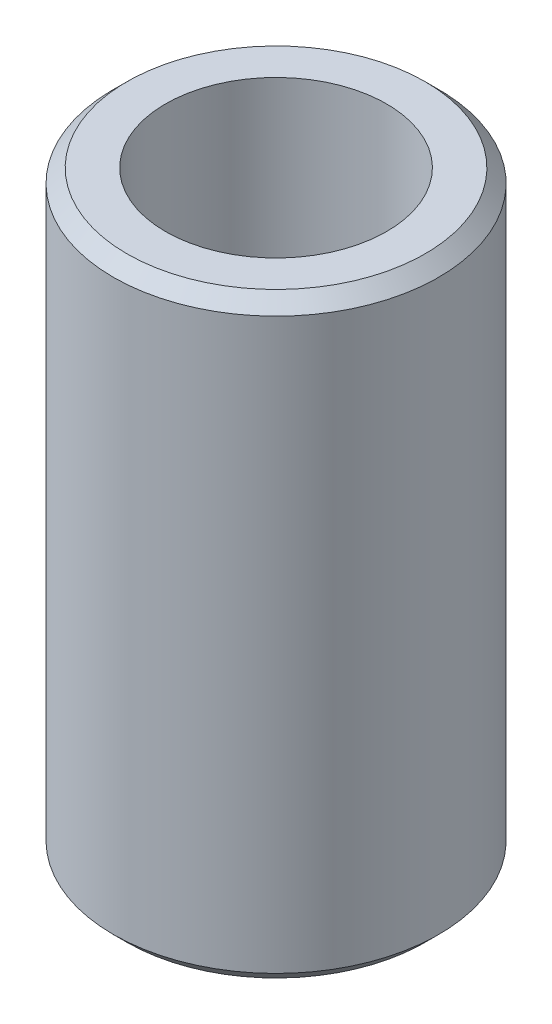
ISO-10303-21;
HEADER;
FILE_DESCRIPTION(('STEP AP214'),'2;1');
FILE_NAME('part.step','',(''),(''),'','','');
FILE_SCHEMA(('AUTOMOTIVE_DESIGN { 1 0 10303 214 1 1 1 1 }'));
ENDSEC;
DATA;
#1=APPLICATION_CONTEXT('core data for automotive mechanical design processes');
#2=APPLICATION_PROTOCOL_DEFINITION('international standard','automotive_design',2000,#1);
#3=PRODUCT_CONTEXT('',#1,'mechanical');
#4=PRODUCT('Part','Part','',(#3));
#5=PRODUCT_RELATED_PRODUCT_CATEGORY('part','',(#4));
#6=PRODUCT_DEFINITION_FORMATION('','',#4);
#7=PRODUCT_DEFINITION_CONTEXT('part definition',#1,'design');
#8=PRODUCT_DEFINITION('design','',#6,#7);
#9=PRODUCT_DEFINITION_SHAPE('','',#8);
#10=(LENGTH_UNIT() NAMED_UNIT(*) SI_UNIT(.MILLI.,.METRE.));
#11=(NAMED_UNIT(*) PLANE_ANGLE_UNIT() SI_UNIT($,.RADIAN.));
#12=(NAMED_UNIT(*) SI_UNIT($,.STERADIAN.) SOLID_ANGLE_UNIT());
#13=UNCERTAINTY_MEASURE_WITH_UNIT(LENGTH_MEASURE(1.E-05),#10,'distance_accuracy_value','');
#14=(GEOMETRIC_REPRESENTATION_CONTEXT(3) GLOBAL_UNCERTAINTY_ASSIGNED_CONTEXT((#13)) GLOBAL_UNIT_ASSIGNED_CONTEXT((#10,
#11,#12)) REPRESENTATION_CONTEXT('',''));
#15=CARTESIAN_POINT('',(0.,0.,0.));
#16=DIRECTION('',(0.,0.,1.));
#17=DIRECTION('',(1.,0.,0.));
#18=AXIS2_PLACEMENT_3D('',#15,#16,#17);
#19=CARTESIAN_POINT('',(0.,17.4625,0.));
#20=DIRECTION('',(0.,-1.,0.));
#21=DIRECTION('',(0.,0.,-1.));
#22=AXIS2_PLACEMENT_3D('',#19,#20,#21);
#23=CYLINDRICAL_SURFACE('',#22,9.52754);
#24=CARTESIAN_POINT('',(0.,-16.66875,0.));
#25=DIRECTION('',(0.,1.,0.));
#26=DIRECTION('',(0.,0.,1.));
#27=AXIS2_PLACEMENT_3D('',#24,#25,#26);
#28=CIRCLE('',#27,9.52754);
#29=CARTESIAN_POINT('',(0.,-16.66875,9.52754));
#30=VERTEX_POINT('',#29);
#31=EDGE_CURVE('E40',#30,#30,#28,.T.);
#32=ORIENTED_EDGE('',*,*,#31,.T.);
#33=EDGE_LOOP('',(#32));
#34=FACE_BOUND('',#33,.T.);
#35=CARTESIAN_POINT('',(0.,16.66875,0.));
#36=DIRECTION('',(0.,1.,0.));
#37=DIRECTION('',(0.,0.,1.));
#38=AXIS2_PLACEMENT_3D('',#35,#36,#37);
#39=CIRCLE('',#38,9.52754);
#40=CARTESIAN_POINT('',(0.,16.66875,9.52754));
#41=VERTEX_POINT('',#40);
#42=EDGE_CURVE('E44',#41,#41,#39,.F.);
#43=ORIENTED_EDGE('',*,*,#42,.T.);
#44=EDGE_LOOP('',(#43));
#45=FACE_BOUND('',#44,.T.);
#46=ADVANCED_FACE('F29',(#34,#45),#23,.T.);
#47=CARTESIAN_POINT('',(0.,17.4625,0.));
#48=DIRECTION('',(0.,1.,0.));
#49=DIRECTION('',(0.,0.,1.));
#50=AXIS2_PLACEMENT_3D('',#47,#48,#49);
#51=PLANE('',#50);
#52=CARTESIAN_POINT('',(0.,17.4625,0.));
#53=DIRECTION('',(0.,1.,0.));
#54=DIRECTION('',(0.,0.,1.));
#55=AXIS2_PLACEMENT_3D('',#52,#53,#54);
#56=CIRCLE('',#55,6.477);
#57=CARTESIAN_POINT('',(0.,17.4625,6.477));
#58=VERTEX_POINT('',#57);
#59=EDGE_CURVE('E50',#58,#58,#56,.T.);
#60=ORIENTED_EDGE('',*,*,#59,.F.);
#61=EDGE_LOOP('',(#60));
#62=FACE_BOUND('',#61,.T.);
#63=CARTESIAN_POINT('',(0.,17.4625,0.));
#64=DIRECTION('',(0.,1.,0.));
#65=DIRECTION('',(0.,0.,1.));
#66=AXIS2_PLACEMENT_3D('',#63,#64,#65);
#67=CIRCLE('',#66,8.73378999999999);
#68=CARTESIAN_POINT('',(0.,17.4625,8.73378999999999));
#69=VERTEX_POINT('',#68);
#70=EDGE_CURVE('E10',#69,#69,#67,.T.);
#71=ORIENTED_EDGE('',*,*,#70,.T.);
#72=EDGE_LOOP('',(#71));
#73=FACE_BOUND('',#72,.T.);
#74=ADVANCED_FACE('F64',(#62,#73),#51,.T.);
#75=CARTESIAN_POINT('',(0.,-17.4625,0.));
#76=DIRECTION('',(0.,1.,0.));
#77=DIRECTION('',(0.,0.,1.));
#78=AXIS2_PLACEMENT_3D('',#75,#76,#77);
#79=PLANE('',#78);
#80=CARTESIAN_POINT('',(0.,-17.4625,0.));
#81=DIRECTION('',(0.,1.,0.));
#82=DIRECTION('',(0.,0.,1.));
#83=AXIS2_PLACEMENT_3D('',#80,#81,#82);
#84=CIRCLE('',#83,6.477);
#85=CARTESIAN_POINT('',(0.,-17.4625,6.477));
#86=VERTEX_POINT('',#85);
#87=EDGE_CURVE('E49',#86,#86,#84,.T.);
#88=ORIENTED_EDGE('',*,*,#87,.T.);
#89=EDGE_LOOP('',(#88));
#90=FACE_BOUND('',#89,.T.);
#91=CARTESIAN_POINT('',(0.,-17.4625,0.));
#92=DIRECTION('',(0.,1.,0.));
#93=DIRECTION('',(0.,0.,1.));
#94=AXIS2_PLACEMENT_3D('',#91,#92,#93);
#95=CIRCLE('',#94,8.73379);
#96=CARTESIAN_POINT('',(0.,-17.4625,8.73378999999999));
#97=VERTEX_POINT('',#96);
#98=EDGE_CURVE('E36',#97,#97,#95,.F.);
#99=ORIENTED_EDGE('',*,*,#98,.T.);
#100=EDGE_LOOP('',(#99));
#101=FACE_BOUND('',#100,.T.);
#102=ADVANCED_FACE('F56',(#90,#101),#79,.F.);
#103=CARTESIAN_POINT('',(0.,-16.66875,0.));
#104=DIRECTION('',(0.,1.,0.));
#105=DIRECTION('',(0.,0.,1.));
#106=AXIS2_PLACEMENT_3D('',#103,#104,#105);
#107=CONICAL_SURFACE('',#106,9.52754,0.785398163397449);
#108=CARTESIAN_POINT('',(0.,-17.4625,8.73378999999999));
#109=CARTESIAN_POINT('',(0.,-17.4542317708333,8.74205822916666));
#110=CARTESIAN_POINT('',(0.,-17.4459635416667,8.75032645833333));
#111=CARTESIAN_POINT('',(0.,-17.4294270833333,8.76686291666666));
#112=CARTESIAN_POINT('',(0.,-17.4211588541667,8.77513114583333));
#113=CARTESIAN_POINT('',(0.,-17.4046223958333,8.79166760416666));
#114=CARTESIAN_POINT('',(0.,-17.3963541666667,8.79993583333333));
#115=CARTESIAN_POINT('',(0.,-17.3798177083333,8.81647229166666));
#116=CARTESIAN_POINT('',(0.,-17.3715494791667,8.82474052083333));
#117=CARTESIAN_POINT('',(0.,-17.3550130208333,8.84127697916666));
#118=CARTESIAN_POINT('',(0.,-17.3467447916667,8.84954520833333));
#119=CARTESIAN_POINT('',(0.,-17.3302083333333,8.86608166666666));
#120=CARTESIAN_POINT('',(0.,-17.3219401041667,8.87434989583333));
#121=CARTESIAN_POINT('',(0.,-17.3054036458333,8.89088635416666));
#122=CARTESIAN_POINT('',(0.,-17.2971354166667,8.89915458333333));
#123=CARTESIAN_POINT('',(0.,-17.2805989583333,8.91569104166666));
#124=CARTESIAN_POINT('',(0.,-17.2723307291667,8.92395927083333));
#125=CARTESIAN_POINT('',(0.,-17.2557942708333,8.94049572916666));
#126=CARTESIAN_POINT('',(0.,-17.2475260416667,8.94876395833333));
#127=CARTESIAN_POINT('',(0.,-17.2309895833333,8.96530041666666));
#128=CARTESIAN_POINT('',(0.,-17.2227213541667,8.97356864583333));
#129=CARTESIAN_POINT('',(0.,-17.2061848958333,8.99010510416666));
#130=CARTESIAN_POINT('',(0.,-17.1979166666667,8.99837333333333));
#131=CARTESIAN_POINT('',(0.,-17.1813802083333,9.01490979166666));
#132=CARTESIAN_POINT('',(0.,-17.1731119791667,9.02317802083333));
#133=CARTESIAN_POINT('',(0.,-17.1565755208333,9.03971447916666));
#134=CARTESIAN_POINT('',(0.,-17.1483072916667,9.04798270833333));
#135=CARTESIAN_POINT('',(0.,-17.1317708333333,9.06451916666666));
#136=CARTESIAN_POINT('',(0.,-17.1235026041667,9.07278739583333));
#137=CARTESIAN_POINT('',(0.,-17.1069661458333,9.08932385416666));
#138=CARTESIAN_POINT('',(0.,-17.0986979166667,9.09759208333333));
#139=CARTESIAN_POINT('',(0.,-17.0821614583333,9.11412854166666));
#140=CARTESIAN_POINT('',(0.,-17.0738932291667,9.12239677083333));
#141=CARTESIAN_POINT('',(0.,-17.0573567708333,9.13893322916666));
#142=CARTESIAN_POINT('',(0.,-17.0490885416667,9.14720145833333));
#143=CARTESIAN_POINT('',(0.,-17.0325520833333,9.16373791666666));
#144=CARTESIAN_POINT('',(0.,-17.0242838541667,9.17200614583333));
#145=CARTESIAN_POINT('',(0.,-17.0077473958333,9.18854260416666));
#146=CARTESIAN_POINT('',(0.,-16.9994791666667,9.19681083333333));
#147=CARTESIAN_POINT('',(0.,-16.9829427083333,9.21334729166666));
#148=CARTESIAN_POINT('',(0.,-16.9746744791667,9.22161552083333));
#149=CARTESIAN_POINT('',(0.,-16.9581380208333,9.23815197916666));
#150=CARTESIAN_POINT('',(0.,-16.9498697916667,9.24642020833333));
#151=CARTESIAN_POINT('',(0.,-16.9333333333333,9.26295666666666));
#152=CARTESIAN_POINT('',(0.,-16.9250651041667,9.27122489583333));
#153=CARTESIAN_POINT('',(0.,-16.9085286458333,9.28776135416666));
#154=CARTESIAN_POINT('',(0.,-16.9002604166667,9.29602958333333));
#155=CARTESIAN_POINT('',(0.,-16.8837239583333,9.31256604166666));
#156=CARTESIAN_POINT('',(0.,-16.8754557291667,9.32083427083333));
#157=CARTESIAN_POINT('',(0.,-16.8589192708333,9.33737072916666));
#158=CARTESIAN_POINT('',(0.,-16.8506510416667,9.34563895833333));
#159=CARTESIAN_POINT('',(0.,-16.8341145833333,9.36217541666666));
#160=CARTESIAN_POINT('',(0.,-16.8258463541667,9.37044364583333));
#161=CARTESIAN_POINT('',(0.,-16.8093098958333,9.38698010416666));
#162=CARTESIAN_POINT('',(0.,-16.8010416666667,9.39524833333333));
#163=CARTESIAN_POINT('',(0.,-16.7845052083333,9.41178479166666));
#164=CARTESIAN_POINT('',(0.,-16.7762369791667,9.42005302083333));
#165=CARTESIAN_POINT('',(0.,-16.7597005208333,9.43658947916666));
#166=CARTESIAN_POINT('',(0.,-16.7514322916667,9.44485770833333));
#167=CARTESIAN_POINT('',(0.,-16.7348958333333,9.46139416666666));
#168=CARTESIAN_POINT('',(0.,-16.7266276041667,9.46966239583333));
#169=CARTESIAN_POINT('',(0.,-16.7100911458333,9.48619885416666));
#170=CARTESIAN_POINT('',(0.,-16.7018229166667,9.49446708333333));
#171=CARTESIAN_POINT('',(0.,-16.6852864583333,9.51100354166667));
#172=CARTESIAN_POINT('',(0.,-16.6770182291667,9.51927177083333));
#173=CARTESIAN_POINT('',(0.,-16.66875,9.52754));
#174=B_SPLINE_CURVE_WITH_KNOTS('',3,(#108,#109,#110,#111,#112,#113,#114,#115,#116,#117,#118,
#119,#120,#121,#122,#123,#124,#125,#126,#127,#128,#129,#130,#131,#132,#133,#134,#135,#136,#137,
#138,#139,#140,#141,#142,#143,#144,#145,#146,#147,#148,#149,#150,#151,#152,#153,#154,#155,#156,
#157,#158,#159,#160,#161,#162,#163,#164,#165,#166,#167,#168,#169,#170,#171,#172,#173),
.UNSPECIFIED.,.F.,.F.,(4,2,2,2,2,2,2,2,2,2,2,2,2,2,2,2,2,2,2,2,2,2,2,2,2,2,2,2,2,2,2,2,4),(0.,
0.0350791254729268,0.0701582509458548,0.105237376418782,0.140316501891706,0.175395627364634,
0.210474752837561,0.245553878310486,0.280633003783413,0.315712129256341,0.350791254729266,
0.385870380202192,0.42094950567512,0.456028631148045,0.491107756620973,0.5261868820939,
0.561266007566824,0.596345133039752,0.631424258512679,0.666503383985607,0.701582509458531,
0.736661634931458,0.771740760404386,0.80681988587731,0.841899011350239,0.876978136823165,
0.912057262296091,0.947136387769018,0.982215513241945,1.01729463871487,1.0523737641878,
1.08745288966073,1.12253201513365),.UNSPECIFIED.);
#175=EDGE_CURVE('BSEAM71',#97,#30,#174,.T.);
#176=ORIENTED_EDGE('',*,*,#98,.F.);
#177=ORIENTED_EDGE('',*,*,#31,.F.);
#178=ORIENTED_EDGE('',*,*,#175,.T.);
#179=ORIENTED_EDGE('',*,*,#175,.F.);
#180=EDGE_LOOP('',(#176,#178,#177,#179));
#181=FACE_BOUND('',#180,.T.);
#182=ADVANCED_FACE('F71',(#181),#107,.T.);
#183=CARTESIAN_POINT('',(0.,17.4625,0.));
#184=DIRECTION('',(0.,-1.,0.));
#185=DIRECTION('',(0.,0.,-1.));
#186=AXIS2_PLACEMENT_3D('',#183,#184,#185);
#187=CONICAL_SURFACE('',#186,8.73378999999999,0.785398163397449);
#188=ORIENTED_EDGE('',*,*,#42,.F.);
#189=EDGE_LOOP('',(#188));
#190=FACE_BOUND('',#189,.T.);
#191=ORIENTED_EDGE('',*,*,#70,.F.);
#192=EDGE_LOOP('',(#191));
#193=FACE_BOUND('',#192,.T.);
#194=ADVANCED_FACE('F31',(#190,#193),#187,.T.);
#195=CARTESIAN_POINT('',(0.,-17.4625,0.));
#196=DIRECTION('',(0.,1.,0.));
#197=DIRECTION('',(0.,0.,1.));
#198=AXIS2_PLACEMENT_3D('',#195,#196,#197);
#199=CYLINDRICAL_SURFACE('',#198,6.477);
#200=ORIENTED_EDGE('',*,*,#87,.F.);
#201=EDGE_LOOP('',(#200));
#202=FACE_BOUND('',#201,.T.);
#203=ORIENTED_EDGE('',*,*,#59,.T.);
#204=EDGE_LOOP('',(#203));
#205=FACE_BOUND('',#204,.T.);
#206=ADVANCED_FACE('F58',(#202,#205),#199,.F.);
#207=CLOSED_SHELL('',(#46,#74,#102,#182,#194,#206));
#208=MANIFOLD_SOLID_BREP('B2',#207);
#209=ADVANCED_BREP_SHAPE_REPRESENTATION('',(#18,#208),#14);
#210=SHAPE_DEFINITION_REPRESENTATION(#9,#209);
ENDSEC;
END-ISO-10303-21;
